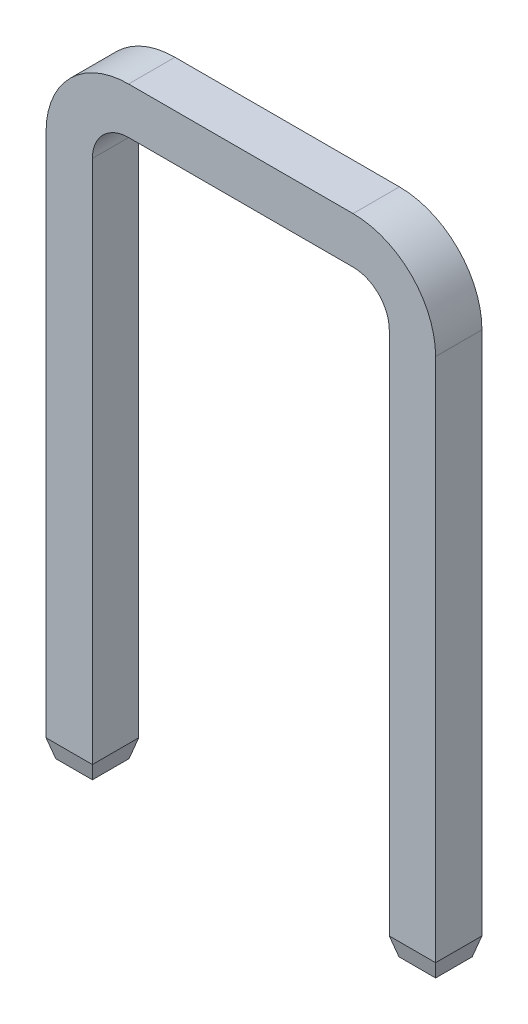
ISO-10303-21;
HEADER;
FILE_DESCRIPTION(('STEP AP214'),'2;1');
FILE_NAME('part.step','',(''),(''),'','','');
FILE_SCHEMA(('AUTOMOTIVE_DESIGN { 1 0 10303 214 1 1 1 1 }'));
ENDSEC;
DATA;
#1=APPLICATION_CONTEXT('core data for automotive mechanical design processes');
#2=APPLICATION_PROTOCOL_DEFINITION('international standard','automotive_design',2000,#1);
#3=PRODUCT_CONTEXT('',#1,'mechanical');
#4=PRODUCT('Part','Part','',(#3));
#5=PRODUCT_RELATED_PRODUCT_CATEGORY('part','',(#4));
#6=PRODUCT_DEFINITION_FORMATION('','',#4);
#7=PRODUCT_DEFINITION_CONTEXT('part definition',#1,'design');
#8=PRODUCT_DEFINITION('design','',#6,#7);
#9=PRODUCT_DEFINITION_SHAPE('','',#8);
#10=(LENGTH_UNIT() NAMED_UNIT(*) SI_UNIT(.MILLI.,.METRE.));
#11=(NAMED_UNIT(*) PLANE_ANGLE_UNIT() SI_UNIT($,.RADIAN.));
#12=(NAMED_UNIT(*) SI_UNIT($,.STERADIAN.) SOLID_ANGLE_UNIT());
#13=UNCERTAINTY_MEASURE_WITH_UNIT(LENGTH_MEASURE(1.E-05),#10,'distance_accuracy_value','');
#14=(GEOMETRIC_REPRESENTATION_CONTEXT(3) GLOBAL_UNCERTAINTY_ASSIGNED_CONTEXT((#13)) GLOBAL_UNIT_ASSIGNED_CONTEXT((#10,
#11,#12)) REPRESENTATION_CONTEXT('',''));
#15=CARTESIAN_POINT('',(0.,0.,0.));
#16=DIRECTION('',(0.,0.,1.));
#17=DIRECTION('',(1.,0.,0.));
#18=AXIS2_PLACEMENT_3D('',#15,#16,#17);
#19=CARTESIAN_POINT('',(-2.7028,-7.738179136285,0.3231673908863));
#20=DIRECTION('',(0.,0.258819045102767,-0.965925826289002));
#21=DIRECTION('',(1.,0.,0.));
#22=AXIS2_PLACEMENT_3D('',#19,#20,#21);
#23=PLANE('',#22);
#24=DIRECTION('',(-1.,0.,0.));
#25=VECTOR('',#24,1.);
#26=CARTESIAN_POINT('',(-2.37,-8.,0.253012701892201));
#27=LINE('',#26,#25);
#28=CARTESIAN_POINT('',(-2.11698729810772,-7.99999999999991,0.25301270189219));
#29=VERTEX_POINT('',#28);
#30=CARTESIAN_POINT('',(-2.62301270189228,-7.9999999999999,0.253012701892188));
#31=VERTEX_POINT('',#30);
#32=EDGE_CURVE('E111',#29,#31,#27,.T.);
#33=ORIENTED_EDGE('',*,*,#32,.F.);
#34=DIRECTION('',(-0.250562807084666,-0.93511312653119,-0.250562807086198));
#35=VECTOR('',#34,1.);
#36=CARTESIAN_POINT('',(-2.05000000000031,-7.75000000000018,0.32));
#37=LINE('',#36,#35);
#38=CARTESIAN_POINT('',(-2.05000000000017,-7.7499999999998,0.320000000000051));
#39=VERTEX_POINT('',#38);
#40=EDGE_CURVE('E132',#39,#29,#37,.T.);
#41=ORIENTED_EDGE('',*,*,#40,.F.);
#42=DIRECTION('',(1.,0.,0.));
#43=VECTOR('',#42,1.);
#44=CARTESIAN_POINT('',(0.,-7.75,0.32));
#45=LINE('',#44,#43);
#46=CARTESIAN_POINT('',(-2.68999999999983,-7.7499999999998,0.320000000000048));
#47=VERTEX_POINT('',#46);
#48=EDGE_CURVE('E130',#47,#39,#45,.T.);
#49=ORIENTED_EDGE('',*,*,#48,.F.);
#50=DIRECTION('',(-0.250562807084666,0.935113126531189,0.2505628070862));
#51=VECTOR('',#50,1.);
#52=CARTESIAN_POINT('',(-2.62301270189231,-7.99999999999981,0.2530127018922));
#53=LINE('',#52,#51);
#54=EDGE_CURVE('E20',#31,#47,#53,.T.);
#55=ORIENTED_EDGE('',*,*,#54,.F.);
#56=EDGE_LOOP('',(#33,#41,#49,#55));
#57=FACE_BOUND('',#56,.T.);
#58=ADVANCED_FACE('F16',(#57),#23,.F.);
#59=CARTESIAN_POINT('',(2.0372,-7.738179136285,0.3231673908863));
#60=DIRECTION('',(0.,0.258819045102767,-0.965925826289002));
#61=DIRECTION('',(1.,0.,0.));
#62=AXIS2_PLACEMENT_3D('',#59,#60,#61);
#63=PLANE('',#62);
#64=DIRECTION('',(-1.,0.,0.));
#65=VECTOR('',#64,1.);
#66=CARTESIAN_POINT('',(2.37,-8.,0.253012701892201));
#67=LINE('',#66,#65);
#68=CARTESIAN_POINT('',(2.62301270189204,-8.,0.25301270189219));
#69=VERTEX_POINT('',#68);
#70=CARTESIAN_POINT('',(2.11698729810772,-7.9999999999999,0.253012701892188));
#71=VERTEX_POINT('',#70);
#72=EDGE_CURVE('E192',#69,#71,#67,.T.);
#73=ORIENTED_EDGE('',*,*,#72,.F.);
#74=DIRECTION('',(-0.250562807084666,-0.93511312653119,-0.250562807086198));
#75=VECTOR('',#74,1.);
#76=CARTESIAN_POINT('',(2.68999999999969,-7.75000000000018,0.32));
#77=LINE('',#76,#75);
#78=CARTESIAN_POINT('',(2.68999999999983,-7.7499999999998,0.320000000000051));
#79=VERTEX_POINT('',#78);
#80=EDGE_CURVE('E137',#79,#69,#77,.T.);
#81=ORIENTED_EDGE('',*,*,#80,.F.);
#82=DIRECTION('',(1.,0.,0.));
#83=VECTOR('',#82,1.);
#84=CARTESIAN_POINT('',(0.,-7.75,0.32));
#85=LINE('',#84,#83);
#86=CARTESIAN_POINT('',(2.05000000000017,-7.7499999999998,0.320000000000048));
#87=VERTEX_POINT('',#86);
#88=EDGE_CURVE('E140',#87,#79,#85,.T.);
#89=ORIENTED_EDGE('',*,*,#88,.F.);
#90=DIRECTION('',(-0.250562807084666,0.935113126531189,0.2505628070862));
#91=VECTOR('',#90,1.);
#92=CARTESIAN_POINT('',(2.11698729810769,-7.99999999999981,0.2530127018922));
#93=LINE('',#92,#91);
#94=EDGE_CURVE('E141',#71,#87,#93,.T.);
#95=ORIENTED_EDGE('',*,*,#94,.F.);
#96=EDGE_LOOP('',(#73,#81,#89,#95));
#97=FACE_BOUND('',#96,.T.);
#98=ADVANCED_FACE('F360',(#97),#63,.F.);
#99=CARTESIAN_POINT('',(-2.635250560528,-8.,-0.2652505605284));
#100=DIRECTION('',(0.,-1.,0.));
#101=DIRECTION('',(1.,0.,0.));
#102=AXIS2_PLACEMENT_3D('',#99,#100,#101);
#103=PLANE('',#102);
#104=ORIENTED_EDGE('',*,*,#32,.T.);
#105=DIRECTION('',(0.,0.,1.));
#106=VECTOR('',#105,1.);
#107=CARTESIAN_POINT('',(-2.62301270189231,-7.99999999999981,0.));
#108=LINE('',#107,#106);
#109=CARTESIAN_POINT('',(-2.62301270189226,-7.99999999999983,-0.25301270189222));
#110=VERTEX_POINT('',#109);
#111=EDGE_CURVE('E115',#110,#31,#108,.T.);
#112=ORIENTED_EDGE('',*,*,#111,.F.);
#113=DIRECTION('',(-1.,0.,0.));
#114=VECTOR('',#113,1.);
#115=CARTESIAN_POINT('',(-2.37,-7.99999999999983,-0.25301270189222));
#116=LINE('',#115,#114);
#117=CARTESIAN_POINT('',(-2.11698729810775,-7.99999999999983,-0.25301270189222));
#118=VERTEX_POINT('',#117);
#119=EDGE_CURVE('E158',#118,#110,#116,.T.);
#120=ORIENTED_EDGE('',*,*,#119,.F.);
#121=DIRECTION('',(0.,0.,-1.));
#122=VECTOR('',#121,1.);
#123=CARTESIAN_POINT('',(-2.1169872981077,-7.99999999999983,0.));
#124=LINE('',#123,#122);
#125=EDGE_CURVE('E117',#29,#118,#124,.T.);
#126=ORIENTED_EDGE('',*,*,#125,.F.);
#127=EDGE_LOOP('',(#104,#112,#120,#126));
#128=FACE_BOUND('',#127,.T.);
#129=ADVANCED_FACE('F113',(#128),#103,.T.);
#130=CARTESIAN_POINT('',(-2.619845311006,-8.011820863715,-0.3328));
#131=DIRECTION('',(-0.965925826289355,-0.258819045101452,0.));
#132=DIRECTION('',(0.,0.,1.));
#133=AXIS2_PLACEMENT_3D('',#130,#131,#132);
#134=PLANE('',#133);
#135=DIRECTION('',(0.,0.,1.));
#136=VECTOR('',#135,1.);
#137=CARTESIAN_POINT('',(-2.69,-7.75,0.));
#138=LINE('',#137,#136);
#139=CARTESIAN_POINT('',(-2.69000000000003,-7.75000000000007,-0.320000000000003));
#140=VERTEX_POINT('',#139);
#141=EDGE_CURVE('E153',#140,#47,#138,.T.);
#142=ORIENTED_EDGE('',*,*,#141,.F.);
#143=DIRECTION('',(-0.250562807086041,0.935113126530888,-0.250562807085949));
#144=VECTOR('',#143,1.);
#145=CARTESIAN_POINT('',(-2.62301270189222,-7.99999999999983,-0.25301270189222));
#146=LINE('',#145,#144);
#147=EDGE_CURVE('E127',#110,#140,#146,.T.);
#148=ORIENTED_EDGE('',*,*,#147,.F.);
#149=ORIENTED_EDGE('',*,*,#111,.T.);
#150=ORIENTED_EDGE('',*,*,#54,.T.);
#151=EDGE_LOOP('',(#142,#148,#149,#150));
#152=FACE_BOUND('',#151,.T.);
#153=ADVANCED_FACE('F125',(#152),#134,.T.);
#154=CARTESIAN_POINT('',(-2.046832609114,-7.738179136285,-0.3328));
#155=DIRECTION('',(0.965925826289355,-0.258819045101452,0.));
#156=DIRECTION('',(0.,0.,1.));
#157=AXIS2_PLACEMENT_3D('',#154,#155,#156);
#158=PLANE('',#157);
#159=ORIENTED_EDGE('',*,*,#125,.T.);
#160=DIRECTION('',(-0.250562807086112,-0.93511312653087,0.250562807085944));
#161=VECTOR('',#160,1.);
#162=CARTESIAN_POINT('',(-2.05,-7.75000000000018,-0.319999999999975));
#163=LINE('',#162,#161);
#164=CARTESIAN_POINT('',(-2.04999999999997,-7.75000000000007,-0.320000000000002));
#165=VERTEX_POINT('',#164);
#166=EDGE_CURVE('E155',#165,#118,#163,.T.);
#167=ORIENTED_EDGE('',*,*,#166,.F.);
#168=DIRECTION('',(0.,0.,-1.));
#169=VECTOR('',#168,1.);
#170=CARTESIAN_POINT('',(-2.05,-7.75,0.));
#171=LINE('',#170,#169);
#172=EDGE_CURVE('E165',#39,#165,#171,.T.);
#173=ORIENTED_EDGE('',*,*,#172,.F.);
#174=ORIENTED_EDGE('',*,*,#40,.T.);
#175=EDGE_LOOP('',(#159,#167,#173,#174));
#176=FACE_BOUND('',#175,.T.);
#177=ADVANCED_FACE('F352',(#176),#158,.T.);
#178=CARTESIAN_POINT('',(-2.7976,-7.9178,0.32));
#179=DIRECTION('',(0.,0.,1.));
#180=DIRECTION('',(1.,0.,0.));
#181=AXIS2_PLACEMENT_3D('',#178,#179,#180);
#182=PLANE('',#181);
#183=DIRECTION('',(0.,1.,0.));
#184=VECTOR('',#183,1.);
#185=CARTESIAN_POINT('',(2.05,-4.125,0.32));
#186=LINE('',#185,#184);
#187=CARTESIAN_POINT('',(2.05,-0.5,0.31999999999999));
#188=VERTEX_POINT('',#187);
#189=EDGE_CURVE('E208',#87,#188,#186,.T.);
#190=ORIENTED_EDGE('',*,*,#189,.F.);
#191=ORIENTED_EDGE('',*,*,#88,.T.);
#192=DIRECTION('',(0.,-1.,0.));
#193=VECTOR('',#192,1.);
#194=CARTESIAN_POINT('',(2.69,-4.125,0.32));
#195=LINE('',#194,#193);
#196=CARTESIAN_POINT('',(2.69,-0.5,0.31999999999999));
#197=VERTEX_POINT('',#196);
#198=EDGE_CURVE('E143',#197,#79,#195,.T.);
#199=ORIENTED_EDGE('',*,*,#198,.F.);
#200=CARTESIAN_POINT('',(1.55,-0.5,0.31999999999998));
#201=DIRECTION('',(0.,0.,1.));
#202=DIRECTION('',(1.,0.,0.));
#203=AXIS2_PLACEMENT_3D('',#200,#201,#202);
#204=CIRCLE('',#203,1.14);
#205=CARTESIAN_POINT('',(1.55,0.64,0.31999999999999));
#206=VERTEX_POINT('',#205);
#207=EDGE_CURVE('E145',#197,#206,#204,.T.);
#208=ORIENTED_EDGE('',*,*,#207,.T.);
#209=DIRECTION('',(1.,0.,0.));
#210=VECTOR('',#209,1.);
#211=CARTESIAN_POINT('',(0.,0.64,0.32));
#212=LINE('',#211,#210);
#213=CARTESIAN_POINT('',(-1.55000000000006,0.64,0.31999999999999));
#214=VERTEX_POINT('',#213);
#215=EDGE_CURVE('E148',#214,#206,#212,.T.);
#216=ORIENTED_EDGE('',*,*,#215,.F.);
#217=CARTESIAN_POINT('',(-1.55,-0.5,0.31999999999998));
#218=DIRECTION('',(0.,0.,1.));
#219=DIRECTION('',(1.,0.,0.));
#220=AXIS2_PLACEMENT_3D('',#217,#218,#219);
#221=CIRCLE('',#220,1.14);
#222=CARTESIAN_POINT('',(-2.69,-0.5,0.31999999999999));
#223=VERTEX_POINT('',#222);
#224=EDGE_CURVE('E150',#214,#223,#221,.T.);
#225=ORIENTED_EDGE('',*,*,#224,.T.);
#226=DIRECTION('',(0.,1.,0.));
#227=VECTOR('',#226,1.);
#228=CARTESIAN_POINT('',(-2.69,-4.125,0.32));
#229=LINE('',#228,#227);
#230=EDGE_CURVE('E199',#47,#223,#229,.T.);
#231=ORIENTED_EDGE('',*,*,#230,.F.);
#232=ORIENTED_EDGE('',*,*,#48,.T.);
#233=DIRECTION('',(0.,-1.,0.));
#234=VECTOR('',#233,1.);
#235=CARTESIAN_POINT('',(-2.05,-4.125,0.32));
#236=LINE('',#235,#234);
#237=CARTESIAN_POINT('',(-2.05,-0.500000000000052,0.31999999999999));
#238=VERTEX_POINT('',#237);
#239=EDGE_CURVE('E161',#238,#39,#236,.T.);
#240=ORIENTED_EDGE('',*,*,#239,.F.);
#241=CARTESIAN_POINT('',(-1.55,-0.5,0.31999999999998));
#242=DIRECTION('',(0.,0.,1.));
#243=DIRECTION('',(1.,0.,0.));
#244=AXIS2_PLACEMENT_3D('',#241,#242,#243);
#245=CIRCLE('',#244,0.5);
#246=CARTESIAN_POINT('',(-1.55,0.,0.31999999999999));
#247=VERTEX_POINT('',#246);
#248=EDGE_CURVE('E162',#247,#238,#245,.T.);
#249=ORIENTED_EDGE('',*,*,#248,.F.);
#250=DIRECTION('',(-1.,0.,0.));
#251=VECTOR('',#250,1.);
#252=CARTESIAN_POINT('',(0.,0.,0.32));
#253=LINE('',#252,#251);
#254=CARTESIAN_POINT('',(1.54999999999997,0.,0.31999999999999));
#255=VERTEX_POINT('',#254);
#256=EDGE_CURVE('E205',#255,#247,#253,.T.);
#257=ORIENTED_EDGE('',*,*,#256,.F.);
#258=CARTESIAN_POINT('',(1.55,-0.5,0.31999999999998));
#259=DIRECTION('',(0.,0.,1.));
#260=DIRECTION('',(1.,0.,0.));
#261=AXIS2_PLACEMENT_3D('',#258,#259,#260);
#262=CIRCLE('',#261,0.5);
#263=EDGE_CURVE('E166',#188,#255,#262,.T.);
#264=ORIENTED_EDGE('',*,*,#263,.F.);
#265=EDGE_LOOP('',(#190,#191,#199,#208,#216,#225,#231,#232,#240,#249,#257,#264));
#266=FACE_BOUND('',#265,.T.);
#267=ADVANCED_FACE('F349',(#266),#182,.T.);
#268=CARTESIAN_POINT('',(2.693167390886,-7.738179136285,-0.3328));
#269=DIRECTION('',(0.965925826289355,-0.258819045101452,0.));
#270=DIRECTION('',(0.,0.,1.));
#271=AXIS2_PLACEMENT_3D('',#268,#269,#270);
#272=PLANE('',#271);
#273=DIRECTION('',(0.,0.,1.));
#274=VECTOR('',#273,1.);
#275=CARTESIAN_POINT('',(2.62301270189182,-8.,0.));
#276=LINE('',#275,#274);
#277=CARTESIAN_POINT('',(2.62301270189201,-7.99999999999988,-0.25301270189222));
#278=VERTEX_POINT('',#277);
#279=EDGE_CURVE('E139',#278,#69,#276,.T.);
#280=ORIENTED_EDGE('',*,*,#279,.F.);
#281=DIRECTION('',(-0.250562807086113,-0.93511312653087,0.250562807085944));
#282=VECTOR('',#281,1.);
#283=CARTESIAN_POINT('',(2.69,-7.75000000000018,-0.319999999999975));
#284=LINE('',#283,#282);
#285=CARTESIAN_POINT('',(2.69000000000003,-7.75000000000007,-0.320000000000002));
#286=VERTEX_POINT('',#285);
#287=EDGE_CURVE('E170',#286,#278,#284,.T.);
#288=ORIENTED_EDGE('',*,*,#287,.F.);
#289=DIRECTION('',(0.,0.,-1.));
#290=VECTOR('',#289,1.);
#291=CARTESIAN_POINT('',(2.69,-7.75,0.));
#292=LINE('',#291,#290);
#293=EDGE_CURVE('E196',#79,#286,#292,.T.);
#294=ORIENTED_EDGE('',*,*,#293,.F.);
#295=ORIENTED_EDGE('',*,*,#80,.T.);
#296=EDGE_LOOP('',(#280,#288,#294,#295));
#297=FACE_BOUND('',#296,.T.);
#298=ADVANCED_FACE('F315',(#297),#272,.T.);
#299=CARTESIAN_POINT('',(2.104749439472,-8.,-0.2652505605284));
#300=DIRECTION('',(0.,-1.,0.));
#301=DIRECTION('',(1.,0.,0.));
#302=AXIS2_PLACEMENT_3D('',#299,#300,#301);
#303=PLANE('',#302);
#304=ORIENTED_EDGE('',*,*,#72,.T.);
#305=DIRECTION('',(0.,0.,1.));
#306=VECTOR('',#305,1.);
#307=CARTESIAN_POINT('',(2.11698729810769,-7.99999999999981,0.));
#308=LINE('',#307,#306);
#309=CARTESIAN_POINT('',(2.11698729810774,-7.99999999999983,-0.25301270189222));
#310=VERTEX_POINT('',#309);
#311=EDGE_CURVE('E144',#310,#71,#308,.T.);
#312=ORIENTED_EDGE('',*,*,#311,.F.);
#313=DIRECTION('',(-1.,0.,0.));
#314=VECTOR('',#313,1.);
#315=CARTESIAN_POINT('',(2.37,-7.99999999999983,-0.25301270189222));
#316=LINE('',#315,#314);
#317=EDGE_CURVE('E172',#278,#310,#316,.T.);
#318=ORIENTED_EDGE('',*,*,#317,.F.);
#319=ORIENTED_EDGE('',*,*,#279,.T.);
#320=EDGE_LOOP('',(#304,#312,#318,#319));
#321=FACE_BOUND('',#320,.T.);
#322=ADVANCED_FACE('F342',(#321),#303,.T.);
#323=CARTESIAN_POINT('',(2.120154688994,-8.011820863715,-0.3328));
#324=DIRECTION('',(-0.965925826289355,-0.258819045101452,0.));
#325=DIRECTION('',(0.,0.,1.));
#326=AXIS2_PLACEMENT_3D('',#323,#324,#325);
#327=PLANE('',#326);
#328=DIRECTION('',(0.,0.,1.));
#329=VECTOR('',#328,1.);
#330=CARTESIAN_POINT('',(2.05,-7.75,0.));
#331=LINE('',#330,#329);
#332=CARTESIAN_POINT('',(2.04999999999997,-7.75000000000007,-0.320000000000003));
#333=VERTEX_POINT('',#332);
#334=EDGE_CURVE('E210',#333,#87,#331,.T.);
#335=ORIENTED_EDGE('',*,*,#334,.F.);
#336=DIRECTION('',(-0.250562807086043,0.935113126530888,-0.250562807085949));
#337=VECTOR('',#336,1.);
#338=CARTESIAN_POINT('',(2.11698729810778,-7.99999999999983,-0.25301270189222));
#339=LINE('',#338,#337);
#340=EDGE_CURVE('E34',#310,#333,#339,.T.);
#341=ORIENTED_EDGE('',*,*,#340,.F.);
#342=ORIENTED_EDGE('',*,*,#311,.T.);
#343=ORIENTED_EDGE('',*,*,#94,.T.);
#344=EDGE_LOOP('',(#335,#341,#342,#343));
#345=FACE_BOUND('',#344,.T.);
#346=ADVANCED_FACE('F339',(#345),#327,.T.);
#347=CARTESIAN_POINT('',(2.69,-7.895,-0.3328));
#348=DIRECTION('',(1.,0.,0.));
#349=DIRECTION('',(0.,1.,0.));
#350=AXIS2_PLACEMENT_3D('',#347,#348,#349);
#351=PLANE('',#350);
#352=ORIENTED_EDGE('',*,*,#198,.T.);
#353=ORIENTED_EDGE('',*,*,#293,.T.);
#354=DIRECTION('',(0.,1.,0.));
#355=VECTOR('',#354,1.);
#356=CARTESIAN_POINT('',(2.69,-3.555,-0.32));
#357=LINE('',#356,#355);
#358=CARTESIAN_POINT('',(2.69,-0.5,-0.32));
#359=VERTEX_POINT('',#358);
#360=EDGE_CURVE('E175',#286,#359,#357,.T.);
#361=ORIENTED_EDGE('',*,*,#360,.T.);
#362=DIRECTION('',(0.,0.,1.));
#363=VECTOR('',#362,1.);
#364=CARTESIAN_POINT('',(2.69,-0.5,0.));
#365=LINE('',#364,#363);
#366=EDGE_CURVE('E149',#359,#197,#365,.T.);
#367=ORIENTED_EDGE('',*,*,#366,.T.);
#368=EDGE_LOOP('',(#352,#353,#361,#367));
#369=FACE_BOUND('',#368,.T.);
#370=ADVANCED_FACE('F309',(#369),#351,.T.);
#371=CARTESIAN_POINT('',(1.55,-0.5,-0.32));
#372=DIRECTION('',(0.,0.,1.));
#373=DIRECTION('',(1.,0.,0.));
#374=AXIS2_PLACEMENT_3D('',#371,#372,#373);
#375=CYLINDRICAL_SURFACE('',#374,1.14);
#376=ORIENTED_EDGE('',*,*,#207,.F.);
#377=ORIENTED_EDGE('',*,*,#366,.F.);
#378=CARTESIAN_POINT('',(1.55,-0.5,-0.32));
#379=DIRECTION('',(0.,0.,1.));
#380=DIRECTION('',(1.,0.,0.));
#381=AXIS2_PLACEMENT_3D('',#378,#379,#380);
#382=CIRCLE('',#381,1.14);
#383=CARTESIAN_POINT('',(1.55,0.64,-0.32));
#384=VERTEX_POINT('',#383);
#385=EDGE_CURVE('E176',#359,#384,#382,.T.);
#386=ORIENTED_EDGE('',*,*,#385,.T.);
#387=DIRECTION('',(0.,0.,-1.));
#388=VECTOR('',#387,1.);
#389=CARTESIAN_POINT('',(1.55,0.64,0.));
#390=LINE('',#389,#388);
#391=EDGE_CURVE('E198',#206,#384,#390,.T.);
#392=ORIENTED_EDGE('',*,*,#391,.F.);
#393=EDGE_LOOP('',(#376,#377,#386,#392));
#394=FACE_BOUND('',#393,.T.);
#395=ADVANCED_FACE('F306',(#394),#375,.T.);
#396=CARTESIAN_POINT('',(1.612,0.64,-0.3328));
#397=DIRECTION('',(0.,1.,0.));
#398=DIRECTION('',(-1.,0.,0.));
#399=AXIS2_PLACEMENT_3D('',#396,#397,#398);
#400=PLANE('',#399);
#401=ORIENTED_EDGE('',*,*,#215,.T.);
#402=ORIENTED_EDGE('',*,*,#391,.T.);
#403=DIRECTION('',(-1.,0.,0.));
#404=VECTOR('',#403,1.);
#405=CARTESIAN_POINT('',(0.,0.640000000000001,-0.32));
#406=LINE('',#405,#404);
#407=CARTESIAN_POINT('',(-1.55000000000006,0.64,-0.32));
#408=VERTEX_POINT('',#407);
#409=EDGE_CURVE('E179',#384,#408,#406,.T.);
#410=ORIENTED_EDGE('',*,*,#409,.T.);
#411=DIRECTION('',(0.,0.,1.));
#412=VECTOR('',#411,1.);
#413=CARTESIAN_POINT('',(-1.55000000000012,0.64,0.));
#414=LINE('',#413,#412);
#415=EDGE_CURVE('E154',#408,#214,#414,.T.);
#416=ORIENTED_EDGE('',*,*,#415,.T.);
#417=EDGE_LOOP('',(#401,#402,#410,#416));
#418=FACE_BOUND('',#417,.T.);
#419=ADVANCED_FACE('F300',(#418),#400,.T.);
#420=CARTESIAN_POINT('',(-1.55,-0.5,-0.32));
#421=DIRECTION('',(0.,0.,1.));
#422=DIRECTION('',(1.,0.,0.));
#423=AXIS2_PLACEMENT_3D('',#420,#421,#422);
#424=CYLINDRICAL_SURFACE('',#423,1.14);
#425=ORIENTED_EDGE('',*,*,#224,.F.);
#426=ORIENTED_EDGE('',*,*,#415,.F.);
#427=CARTESIAN_POINT('',(-1.55,-0.5,-0.32));
#428=DIRECTION('',(0.,0.,1.));
#429=DIRECTION('',(1.,0.,0.));
#430=AXIS2_PLACEMENT_3D('',#427,#428,#429);
#431=CIRCLE('',#430,1.14);
#432=CARTESIAN_POINT('',(-2.69,-0.5,-0.32));
#433=VERTEX_POINT('',#432);
#434=EDGE_CURVE('E180',#408,#433,#431,.T.);
#435=ORIENTED_EDGE('',*,*,#434,.T.);
#436=DIRECTION('',(0.,0.,-1.));
#437=VECTOR('',#436,1.);
#438=CARTESIAN_POINT('',(-2.69,-0.5,0.));
#439=LINE('',#438,#437);
#440=EDGE_CURVE('E159',#223,#433,#439,.T.);
#441=ORIENTED_EDGE('',*,*,#440,.F.);
#442=EDGE_LOOP('',(#425,#426,#435,#441));
#443=FACE_BOUND('',#442,.T.);
#444=ADVANCED_FACE('F296',(#443),#424,.T.);
#445=CARTESIAN_POINT('',(-2.69,-0.355,-0.3328));
#446=DIRECTION('',(-1.,0.,0.));
#447=DIRECTION('',(0.,-1.,0.));
#448=AXIS2_PLACEMENT_3D('',#445,#446,#447);
#449=PLANE('',#448);
#450=ORIENTED_EDGE('',*,*,#230,.T.);
#451=ORIENTED_EDGE('',*,*,#440,.T.);
#452=DIRECTION('',(0.,-1.,0.));
#453=VECTOR('',#452,1.);
#454=CARTESIAN_POINT('',(-2.69,-3.555,-0.32));
#455=LINE('',#454,#453);
#456=EDGE_CURVE('E183',#433,#140,#455,.T.);
#457=ORIENTED_EDGE('',*,*,#456,.T.);
#458=ORIENTED_EDGE('',*,*,#141,.T.);
#459=EDGE_LOOP('',(#450,#451,#457,#458));
#460=FACE_BOUND('',#459,.T.);
#461=ADVANCED_FACE('F287',(#460),#449,.T.);
#462=CARTESIAN_POINT('',(-2.7028,-7.738179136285,-0.3231673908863));
#463=DIRECTION('',(0.,-0.258819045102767,-0.965925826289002));
#464=DIRECTION('',(1.,0.,0.));
#465=AXIS2_PLACEMENT_3D('',#462,#463,#464);
#466=PLANE('',#465);
#467=ORIENTED_EDGE('',*,*,#119,.T.);
#468=ORIENTED_EDGE('',*,*,#147,.T.);
#469=DIRECTION('',(1.,0.,0.));
#470=VECTOR('',#469,1.);
#471=CARTESIAN_POINT('',(0.,-7.75,-0.32));
#472=LINE('',#471,#470);
#473=EDGE_CURVE('E226',#140,#165,#472,.T.);
#474=ORIENTED_EDGE('',*,*,#473,.T.);
#475=ORIENTED_EDGE('',*,*,#166,.T.);
#476=EDGE_LOOP('',(#467,#468,#474,#475));
#477=FACE_BOUND('',#476,.T.);
#478=ADVANCED_FACE('F285',(#477),#466,.T.);
#479=CARTESIAN_POINT('',(-2.05,-7.895,-0.3328));
#480=DIRECTION('',(1.,0.,0.));
#481=DIRECTION('',(0.,1.,0.));
#482=AXIS2_PLACEMENT_3D('',#479,#480,#481);
#483=PLANE('',#482);
#484=ORIENTED_EDGE('',*,*,#239,.T.);
#485=ORIENTED_EDGE('',*,*,#172,.T.);
#486=DIRECTION('',(0.,1.,0.));
#487=VECTOR('',#486,1.);
#488=CARTESIAN_POINT('',(-2.05,-3.555,-0.32));
#489=LINE('',#488,#487);
#490=CARTESIAN_POINT('',(-2.05,-0.500000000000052,-0.32));
#491=VERTEX_POINT('',#490);
#492=EDGE_CURVE('E188',#165,#491,#489,.T.);
#493=ORIENTED_EDGE('',*,*,#492,.T.);
#494=DIRECTION('',(0.,0.,-1.));
#495=VECTOR('',#494,1.);
#496=CARTESIAN_POINT('',(-2.05,-0.500000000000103,0.));
#497=LINE('',#496,#495);
#498=EDGE_CURVE('E164',#238,#491,#497,.T.);
#499=ORIENTED_EDGE('',*,*,#498,.F.);
#500=EDGE_LOOP('',(#484,#485,#493,#499));
#501=FACE_BOUND('',#500,.T.);
#502=ADVANCED_FACE('F280',(#501),#483,.T.);
#503=CARTESIAN_POINT('',(-1.55,-0.5,-0.32));
#504=DIRECTION('',(0.,0.,1.));
#505=DIRECTION('',(1.,0.,0.));
#506=AXIS2_PLACEMENT_3D('',#503,#504,#505);
#507=CYLINDRICAL_SURFACE('',#506,0.5);
#508=ORIENTED_EDGE('',*,*,#248,.T.);
#509=ORIENTED_EDGE('',*,*,#498,.T.);
#510=CARTESIAN_POINT('',(-1.55,-0.5,-0.32));
#511=DIRECTION('',(0.,0.,1.));
#512=DIRECTION('',(1.,0.,0.));
#513=AXIS2_PLACEMENT_3D('',#510,#511,#512);
#514=CIRCLE('',#513,0.5);
#515=CARTESIAN_POINT('',(-1.55,0.,-0.32));
#516=VERTEX_POINT('',#515);
#517=EDGE_CURVE('E184',#491,#516,#514,.F.);
#518=ORIENTED_EDGE('',*,*,#517,.T.);
#519=DIRECTION('',(0.,0.,-1.));
#520=VECTOR('',#519,1.);
#521=CARTESIAN_POINT('',(-1.55,0.,0.));
#522=LINE('',#521,#520);
#523=EDGE_CURVE('E169',#247,#516,#522,.T.);
#524=ORIENTED_EDGE('',*,*,#523,.F.);
#525=EDGE_LOOP('',(#508,#509,#518,#524));
#526=FACE_BOUND('',#525,.T.);
#527=ADVANCED_FACE('F275',(#526),#507,.F.);
#528=CARTESIAN_POINT('',(-1.612,0.,-0.3328));
#529=DIRECTION('',(0.,-1.,0.));
#530=DIRECTION('',(1.,0.,0.));
#531=AXIS2_PLACEMENT_3D('',#528,#529,#530);
#532=PLANE('',#531);
#533=ORIENTED_EDGE('',*,*,#256,.T.);
#534=ORIENTED_EDGE('',*,*,#523,.T.);
#535=DIRECTION('',(1.,0.,0.));
#536=VECTOR('',#535,1.);
#537=CARTESIAN_POINT('',(0.,0.,-0.32));
#538=LINE('',#537,#536);
#539=CARTESIAN_POINT('',(1.54999999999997,0.,-0.32));
#540=VERTEX_POINT('',#539);
#541=EDGE_CURVE('E187',#516,#540,#538,.T.);
#542=ORIENTED_EDGE('',*,*,#541,.T.);
#543=DIRECTION('',(0.,0.,-1.));
#544=VECTOR('',#543,1.);
#545=CARTESIAN_POINT('',(1.54999999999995,0.,0.));
#546=LINE('',#545,#544);
#547=EDGE_CURVE('E168',#255,#540,#546,.T.);
#548=ORIENTED_EDGE('',*,*,#547,.F.);
#549=EDGE_LOOP('',(#533,#534,#542,#548));
#550=FACE_BOUND('',#549,.T.);
#551=ADVANCED_FACE('F268',(#550),#532,.T.);
#552=CARTESIAN_POINT('',(1.55,-0.5,-0.32));
#553=DIRECTION('',(0.,0.,1.));
#554=DIRECTION('',(1.,0.,0.));
#555=AXIS2_PLACEMENT_3D('',#552,#553,#554);
#556=CYLINDRICAL_SURFACE('',#555,0.5);
#557=ORIENTED_EDGE('',*,*,#263,.T.);
#558=ORIENTED_EDGE('',*,*,#547,.T.);
#559=CARTESIAN_POINT('',(1.55,-0.5,-0.32));
#560=DIRECTION('',(0.,0.,1.));
#561=DIRECTION('',(1.,0.,0.));
#562=AXIS2_PLACEMENT_3D('',#559,#560,#561);
#563=CIRCLE('',#562,0.5);
#564=CARTESIAN_POINT('',(2.05,-0.5,-0.32));
#565=VERTEX_POINT('',#564);
#566=EDGE_CURVE('E189',#540,#565,#563,.F.);
#567=ORIENTED_EDGE('',*,*,#566,.T.);
#568=DIRECTION('',(0.,0.,-1.));
#569=VECTOR('',#568,1.);
#570=CARTESIAN_POINT('',(2.05,-0.5,0.));
#571=LINE('',#570,#569);
#572=EDGE_CURVE('E173',#188,#565,#571,.T.);
#573=ORIENTED_EDGE('',*,*,#572,.F.);
#574=EDGE_LOOP('',(#557,#558,#567,#573));
#575=FACE_BOUND('',#574,.T.);
#576=ADVANCED_FACE('F261',(#575),#556,.F.);
#577=CARTESIAN_POINT('',(2.05,-0.355,-0.3328));
#578=DIRECTION('',(-1.,0.,0.));
#579=DIRECTION('',(0.,-1.,0.));
#580=AXIS2_PLACEMENT_3D('',#577,#578,#579);
#581=PLANE('',#580);
#582=ORIENTED_EDGE('',*,*,#189,.T.);
#583=ORIENTED_EDGE('',*,*,#572,.T.);
#584=DIRECTION('',(0.,-1.,0.));
#585=VECTOR('',#584,1.);
#586=CARTESIAN_POINT('',(2.05,-3.555,-0.32));
#587=LINE('',#586,#585);
#588=EDGE_CURVE('E26',#565,#333,#587,.T.);
#589=ORIENTED_EDGE('',*,*,#588,.T.);
#590=ORIENTED_EDGE('',*,*,#334,.T.);
#591=EDGE_LOOP('',(#582,#583,#589,#590));
#592=FACE_BOUND('',#591,.T.);
#593=ADVANCED_FACE('F252',(#592),#581,.T.);
#594=CARTESIAN_POINT('',(2.0372,-7.738179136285,-0.3231673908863));
#595=DIRECTION('',(0.,-0.258819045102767,-0.965925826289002));
#596=DIRECTION('',(1.,0.,0.));
#597=AXIS2_PLACEMENT_3D('',#594,#595,#596);
#598=PLANE('',#597);
#599=ORIENTED_EDGE('',*,*,#317,.T.);
#600=ORIENTED_EDGE('',*,*,#340,.T.);
#601=DIRECTION('',(1.,0.,0.));
#602=VECTOR('',#601,1.);
#603=CARTESIAN_POINT('',(0.,-7.75,-0.32));
#604=LINE('',#603,#602);
#605=EDGE_CURVE('E11',#333,#286,#604,.T.);
#606=ORIENTED_EDGE('',*,*,#605,.T.);
#607=ORIENTED_EDGE('',*,*,#287,.T.);
#608=EDGE_LOOP('',(#599,#600,#606,#607));
#609=FACE_BOUND('',#608,.T.);
#610=ADVANCED_FACE('F317',(#609),#598,.T.);
#611=CARTESIAN_POINT('',(-2.7976,-7.9178,-0.32));
#612=DIRECTION('',(0.,0.,1.));
#613=DIRECTION('',(1.,0.,0.));
#614=AXIS2_PLACEMENT_3D('',#611,#612,#613);
#615=PLANE('',#614);
#616=ORIENTED_EDGE('',*,*,#588,.F.);
#617=ORIENTED_EDGE('',*,*,#566,.F.);
#618=ORIENTED_EDGE('',*,*,#541,.F.);
#619=ORIENTED_EDGE('',*,*,#517,.F.);
#620=ORIENTED_EDGE('',*,*,#492,.F.);
#621=ORIENTED_EDGE('',*,*,#473,.F.);
#622=ORIENTED_EDGE('',*,*,#456,.F.);
#623=ORIENTED_EDGE('',*,*,#434,.F.);
#624=ORIENTED_EDGE('',*,*,#409,.F.);
#625=ORIENTED_EDGE('',*,*,#385,.F.);
#626=ORIENTED_EDGE('',*,*,#360,.F.);
#627=ORIENTED_EDGE('',*,*,#605,.F.);
#628=EDGE_LOOP('',(#616,#617,#618,#619,#620,#621,#622,#623,#624,#625,#626,#627));
#629=FACE_BOUND('',#628,.T.);
#630=ADVANCED_FACE('F18',(#629),#615,.F.);
#631=CLOSED_SHELL('',(#58,#98,#129,#153,#177,#267,#298,#322,#346,#370,#395,#419,#444,#461,#478,
#502,#527,#551,#576,#593,#610,#630));
#632=MANIFOLD_SOLID_BREP('B1',#631);
#633=ADVANCED_BREP_SHAPE_REPRESENTATION('',(#18,#632),#14);
#634=SHAPE_DEFINITION_REPRESENTATION(#9,#633);
ENDSEC;
END-ISO-10303-21;
